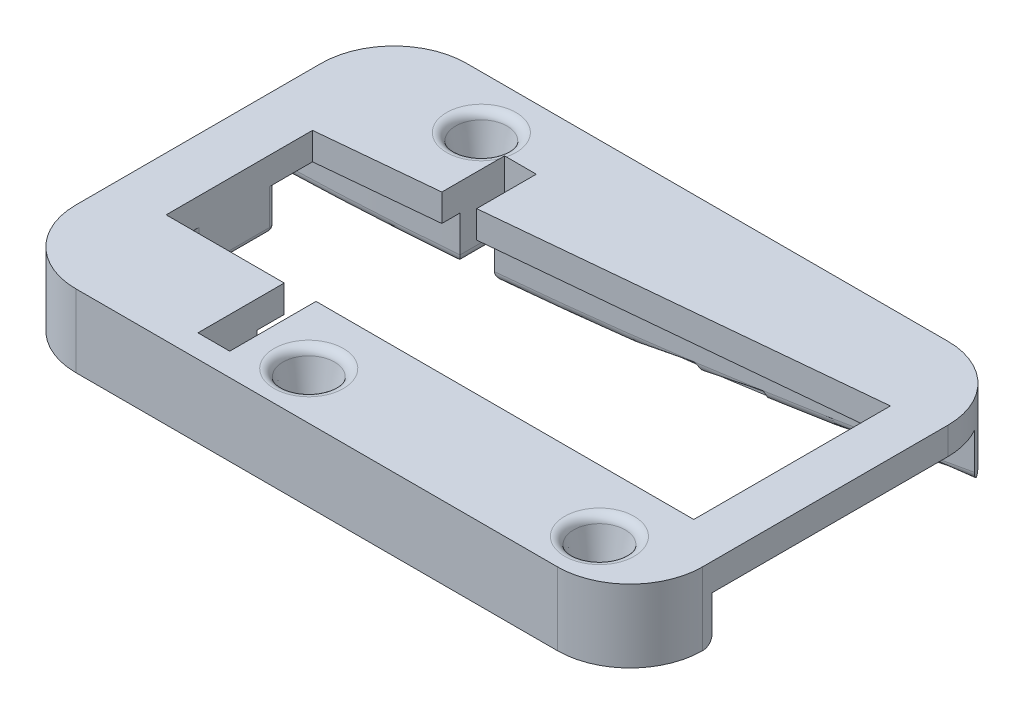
from build123d import *
from OCP.BRepFilletAPI import BRepFilletAPI_MakeChamfer

# Parameters (mm, degrees)
SKICA3_W                 = 70
SKICA3_H                 = 48
P_IDAT_VYSUNUT_M5_DEPTH  = 8
ODEBRAT_VYSUNUT_M3_DEPTH = 5
SKICA6_R                 = 2
ODEBRAT_VYSUNUT_M4_DEPTH = 10
SKICA8_OUTSIDE_W         = 89.05
SKICA8_OUTSIDE_H         = 67.05
SKICA8_OUTSIDE_W_2       = 69
SKICA8_OUTSIDE_H_2       = 43
ODEBRAT_VYSUNUT_M6_DEPTH = 10
ZKOSEN_2_SIZE            = 5
ZKOSEN_2_SIZE2           = 1
SKICA10_W                = 2.5
SKICA10_H                = 9
P_IDAT_VYSUNUT_M6_DEPTH  = 4.5
ZAOBLIT1_R               = 1
ZAOBLIT2_R               = 0.6
ZAOBLIT3_R               = 1
ODEBRAT_VYSUNUT_M7_DEPTH = 3
ZAOBLIT5_R               = 8


with BuildPart() as part:
    # Skica3 → P_idat vysunut_m5 (new body)
    with BuildSketch(Plane(origin=(0, 0, 0), x_dir=(1, 0, 0), z_dir=(0, 1, 0))):
        with Locations((48.600307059, 24)):
            Rectangle(SKICA3_W, SKICA3_H)
    extrude(amount=P_IDAT_VYSUNUT_M5_DEPTH)

    # Skica4 → Odebrat vysunut_m3 (cut)
    with BuildSketch(Plane.XZ):
        with BuildLine():
            Line((37.012772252, -14.021596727), (37.012772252, -7.521596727))
            Line((37.012772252, -7.521596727), (33.512772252, -7.521596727))
            Line((33.512772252, -7.521596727), (33.512772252, -14.021596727))
            Line((33.512772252, -14.021596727), (13.812772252, -14.021596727))
            Line((13.812772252, -14.021596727), (13.812772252, -35.271596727))
            ThreePointArc((13.812772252, -35.271596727), (23.670411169, -35.680505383), (33.512772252, -36.364741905))
            Line((33.512772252, -36.364741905), (33.512772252, -41.271596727))
            Line((33.512772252, -41.271596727), (37.012772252, -41.271596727))
            Line((37.012772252, -41.271596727), (37.012772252, -36.674809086))
            ThreePointArc((37.012772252, -36.674809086), (71.233698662, -41.57839243), (104.810871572, -49.805809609))
            Line((104.810871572, -49.805809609), (139.794259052, -60.217946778))
            Line((139.794259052, -60.217946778), (145.853156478, -39.860862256))
            Line((145.853156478, -39.860862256), (129.593871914, -35.021596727))
            Line((129.593871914, -35.021596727), (143.312772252, -35.021596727))
            Line((143.312772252, -35.021596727), (143.312772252, -14.021596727))
            Line((143.312772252, -14.021596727), (37.012772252, -14.021596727))
        make_face()
    extrude(amount=-ODEBRAT_VYSUNUT_M3_DEPTH, mode=Mode.SUBTRACT)

    # Skica6 → Odebrat vysunut_m4 (cut)
    with BuildSketch(Plane.XZ):
        with Locations(Location((75.012772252, -10.221596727, 0), (0, 0, 270))):
            Circle(SKICA6_R)
        with Locations(Location((43.012772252, -10.221596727, 0), (0, 0, 270))):
            Circle(SKICA6_R)
        with Locations(Location((30.012772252, -42.221596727, 0), (0, 0, 270))):
            Circle(SKICA6_R)
    extrude(amount=-ODEBRAT_VYSUNUT_M4_DEPTH, mode=Mode.SUBTRACT)

    # Skica8 outside → Odebrat vysunut_m6 (cut)
    with BuildSketch(Plane(origin=(0, 8, 0), x_dir=(1, 0, 0), z_dir=(0, 1, 0))):
        with Locations((48.6, 24)):
            Rectangle(SKICA8_OUTSIDE_W, SKICA8_OUTSIDE_H)
        with Locations((49.100307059, 26.5)):
            Rectangle(SKICA8_OUTSIDE_W_2, SKICA8_OUTSIDE_H_2, mode=Mode.SUBTRACT)
    extrude(amount=-ODEBRAT_VYSUNUT_M6_DEPTH, mode=Mode.SUBTRACT)

    # Zkosen_2: one chamfer whose edges measure the first distance from different faces: ONE call of the kernel's chamfer builder (chamfer() names one face for all edges)
    zkosen_2_edges_1 = [part.edges().sort_by_distance(p)[0] for p in [
        (75.012772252, 8, -8.221596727),
    ]]
    zkosen_2_side_1 = [part.faces().sort_by_distance(p)[0] for p in [
        (75.012772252, 4, -8.221596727),
    ]]
    zkosen_2_edges_2 = [part.edges().sort_by_distance(p)[0] for p in [
        (43.012772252, 8, -8.221596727),
    ]]
    zkosen_2_side_2 = [part.faces().sort_by_distance(p)[0] for p in [
        (43.012772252, 4, -8.221596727),
    ]]
    zkosen_2_edges_3 = [part.edges().sort_by_distance(p)[0] for p in [
        (30.012772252, 8, -40.221596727),
    ]]
    zkosen_2_side_3 = [part.faces().sort_by_distance(p)[0] for p in [
        (30.012772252, 4, -40.221596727),
    ]]
    zkosen_2 = BRepFilletAPI_MakeChamfer(part.part.solid().wrapped)
    for e in zkosen_2_edges_1:
        zkosen_2.Add(ZKOSEN_2_SIZE, ZKOSEN_2_SIZE2, e.wrapped, zkosen_2_side_1[0].wrapped)  # the first distance lies on this face
    for e in zkosen_2_edges_2:
        zkosen_2.Add(ZKOSEN_2_SIZE, ZKOSEN_2_SIZE2, e.wrapped, zkosen_2_side_2[0].wrapped)  # the first distance lies on this face
    for e in zkosen_2_edges_3:
        zkosen_2.Add(ZKOSEN_2_SIZE, ZKOSEN_2_SIZE2, e.wrapped, zkosen_2_side_3[0].wrapped)  # the first distance lies on this face
    add(Compound.cast(zkosen_2.Shape()), mode=Mode.REPLACE)

    # Skica10 → P_idat vysunut_m6 (add)
    with BuildSketch(Plane.XZ.offset(-5)):
        with Locations((19.262772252, -24.521596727)):
            Rectangle(SKICA10_W, SKICA10_H)
    extrude(amount=P_IDAT_VYSUNUT_M6_DEPTH)

    # Zaoblit1
    zaoblit1_edges = [part.edges().sort_by_distance(p)[0] for p in [
        (37.012772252, 0, -10.771596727),
        (35.262772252, 0, -7.521596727),
        (33.512772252, 0, -10.771596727),
        (24.056539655, 0, -14.021596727),
        (33.512772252, 0, -38.818169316),
        (35.262772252, 0, -41.271596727),
        (37.012772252, 0, -38.973202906),
        (60.432503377, 0, -39.660067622),
        (60.306539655, 0, -14.021596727),
        (24.0637224, 0, -35.702550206),
    ]]
    fillet(zaoblit1_edges, radius=ZAOBLIT1_R)

    # Zaoblit2
    zaoblit2_edges = [part.edges().sort_by_distance(p)[0] for p in [
        (20.512772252, 2.75, -29.021596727),
        (20.512772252, 2.75, -20.021596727),
        (18.012772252, 2.75, -20.021596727),
        (18.012772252, 2.75, -29.021596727),
        (20.512772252, 0.5, -24.521596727),
        (19.262772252, 0.5, -20.021596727),
        (18.012772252, 0.5, -24.521596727),
        (19.262772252, 0.5, -29.021596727),
    ]]
    fillet(zaoblit2_edges, radius=ZAOBLIT2_R)

    # Zaoblit3
    zaoblit3_edges = [part.edges().sort_by_distance(p)[0] for p in [
        (75.012772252, 8, -7.221596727),
        (43.012772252, 8, -7.221596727),
        (30.012772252, 8, -39.221596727),
    ]]
    fillet(zaoblit3_edges, radius=ZAOBLIT3_R)

    # Skica11 → Odebrat vysunut_m7 (cut)
    with BuildSketch(Plane.XZ.offset(-5)):
        Polygon((78.600307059, -17.021596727), (37.012772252, -17.021596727), (37.012772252, -7.521596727), (33.512772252, -7.521596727), (33.512772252, -17.021596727), (20.512772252, -17.021596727), (20.512772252, -33.133280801), (33.512772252, -34.372134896), (33.512772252, -41.271596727), (37.012772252, -41.271596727), (37.012772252, -34.705672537), (78.600307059, -38.668817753), align=None)
    extrude(amount=-ODEBRAT_VYSUNUT_M7_DEPTH, mode=Mode.SUBTRACT)

    # Zaoblit5
    zaoblit5_edges = [part.edges().sort_by_distance(p)[0] for p in [
        (83.600307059, 4, -48),
        (83.600307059, 4, -5),
        (14.600307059, 4, -5),
        (14.600307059, 4, -48),
    ]]
    fillet(zaoblit5_edges, radius=ZAOBLIT5_R)


solid = part.part
